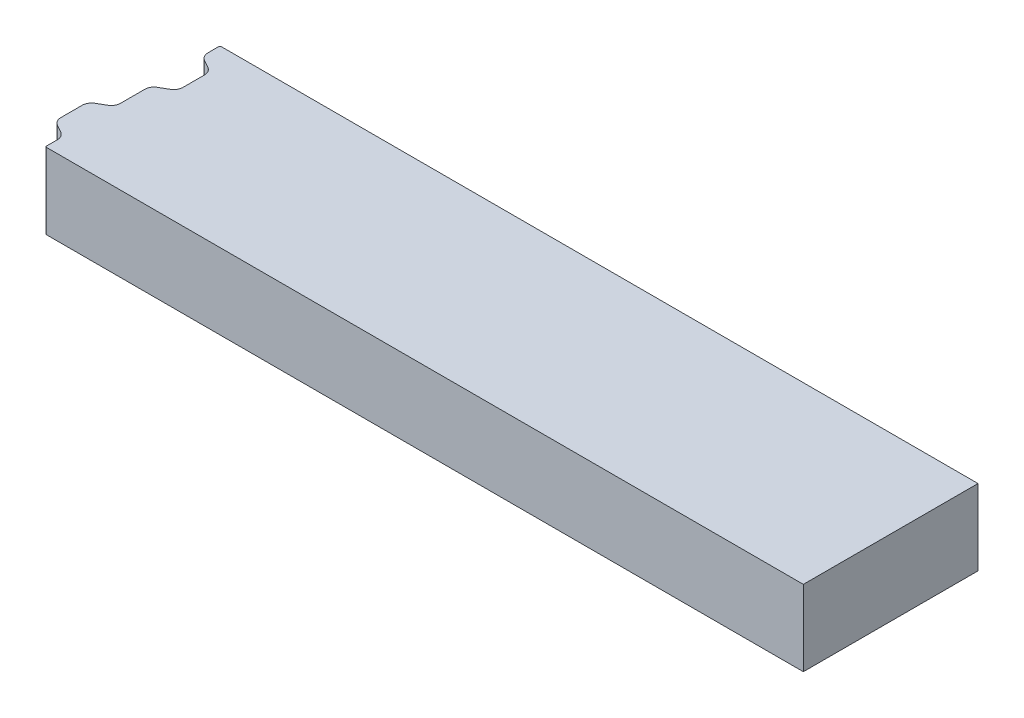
from build123d import *

# Parameters (mm, degrees)
EXTRUSION1_DEPTH = 13


with BuildPart() as part:
    # Esquisse1 → Extrusion1 (new body)
    with BuildSketch(Plane(origin=(0, 0, 0), x_dir=(1, 0, 0), z_dir=(0, 1, 0))):
        with BuildLine():
            Line((130.2, 30), (130.2, 0))
            Line((130.2, 0), (0.2, 0))
            ThreePointArc((0.2, 0), (0.058578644, 0.058578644), (0, 0.2))
            Line((0, 0.2), (0, 2.076239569))
            ThreePointArc((0, 2.076239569), (-0.214359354, 2.876239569), (-0.8, 3.461880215))
            Line((-0.8, 3.461880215), (-2.2, 4.270170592))
            ThreePointArc((-2.2, 4.270170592), (-2.785640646, 4.855811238), (-3, 5.655811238))
            Line((-3, 5.655811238), (-3, 9.339621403))
            ThreePointArc((-3, 9.339621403), (-2.786262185, 10.1385439), (-2.202153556, 10.72401646))
            Line((-2.202153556, 10.72401646), (-0.797846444, 11.537707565))
            ThreePointArc((-0.797846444, 11.537707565), (-0.213737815, 12.123180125), (0, 12.922102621))
            Line((0, 12.922102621), (0, 17.077897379))
            ThreePointArc((0, 17.077897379), (0.213737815, 17.876819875), (0.797846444, 18.462292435))
            Line((0.797846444, 18.462292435), (2.202153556, 19.27598354))
            ThreePointArc((2.202153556, 19.27598354), (2.786262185, 19.8614561), (3, 20.660378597))
            Line((3, 20.660378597), (3, 24.344188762))
            ThreePointArc((3, 24.344188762), (2.785640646, 25.144188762), (2.2, 25.729829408))
            Line((2.2, 25.729829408), (0.8, 26.538119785))
            ThreePointArc((0.8, 26.538119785), (0.214359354, 27.123760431), (0, 27.923760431))
            Line((0, 27.923760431), (0, 29.8))
            ThreePointArc((0, 29.8), (0.058578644, 29.941421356), (0.2, 30))
            Line((0.2, 30), (130.2, 30))
        make_face()
    extrude(amount=EXTRUSION1_DEPTH)


solid = part.part
